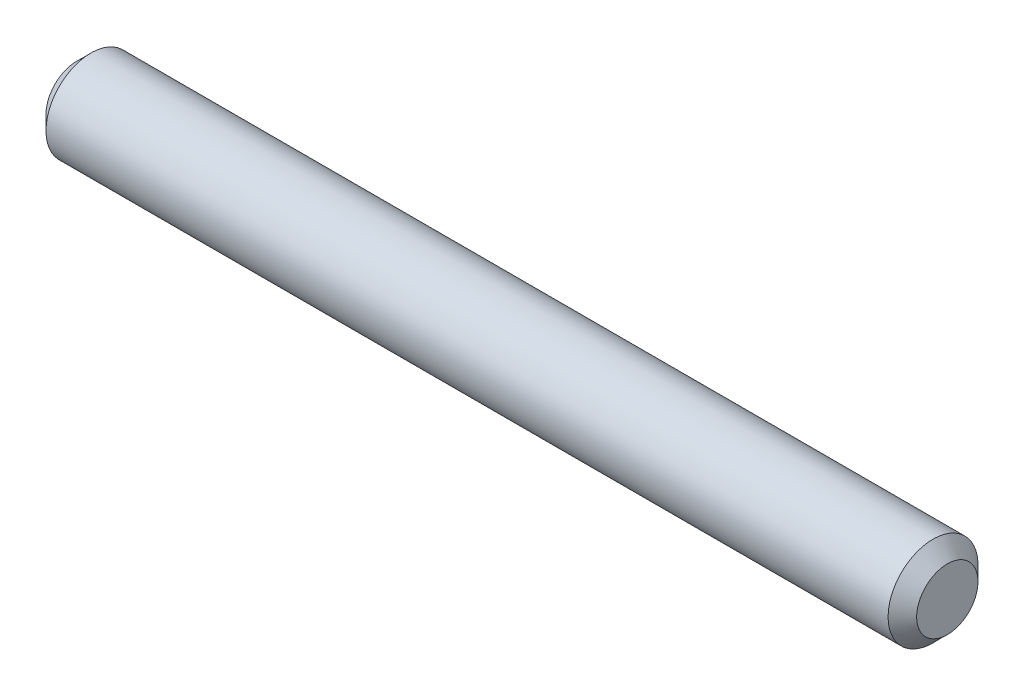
from build123d import *


with BuildPart() as part:
    # Sketch1 → Revolve1 (revolve)
    with BuildSketch(Plane.XY, mode=Mode.PRIVATE) as revolve1_sk:
        Polygon((0, 0), (0, 0.5461), (0.254, 0.8001), (15.24, 0.8001), (15.494, 0.5461), (15.494, 0), align=None)
    revolve(revolve1_sk.sketch.rotate(Axis((0, 0, 0), (1, 0, 0)), 90), axis=Axis((0, 0, 0), (1, 0, 0)))


solid = part.part
